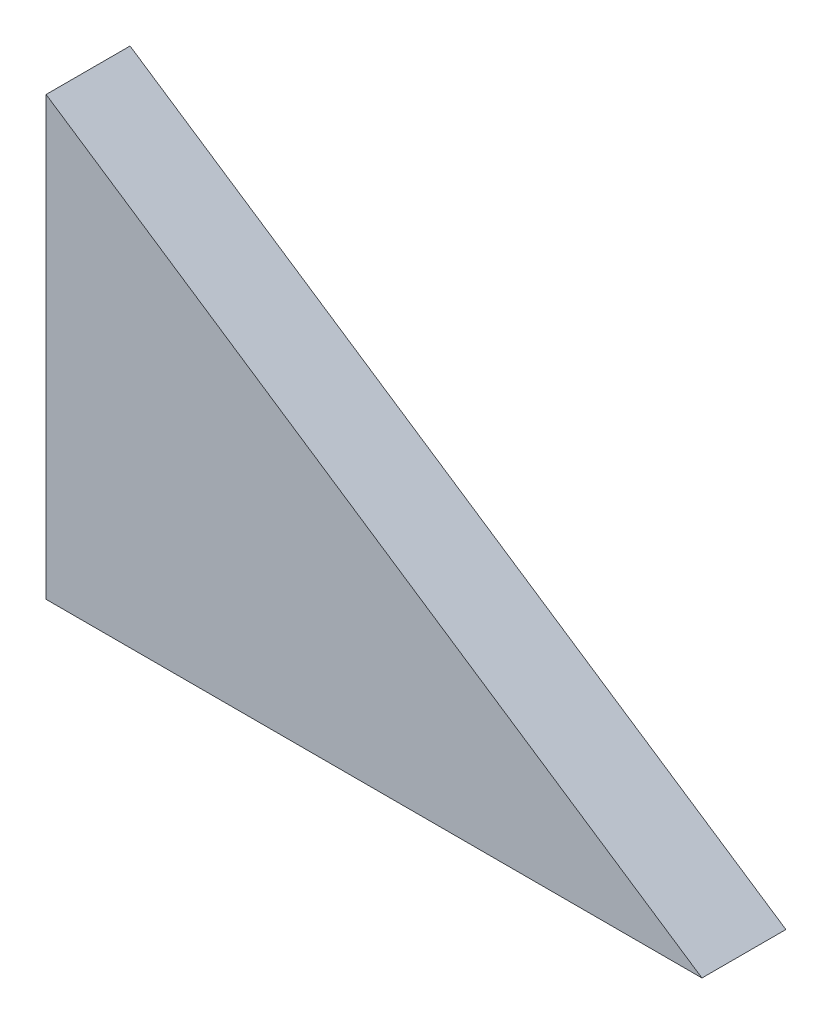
ISO-10303-21;
HEADER;
FILE_DESCRIPTION(('STEP AP214'),'2;1');
FILE_NAME('part.step','',(''),(''),'','','');
FILE_SCHEMA(('AUTOMOTIVE_DESIGN { 1 0 10303 214 1 1 1 1 }'));
ENDSEC;
DATA;
#1=APPLICATION_CONTEXT('core data for automotive mechanical design processes');
#2=APPLICATION_PROTOCOL_DEFINITION('international standard','automotive_design',2000,#1);
#3=PRODUCT_CONTEXT('',#1,'mechanical');
#4=PRODUCT('Part','Part','',(#3));
#5=PRODUCT_RELATED_PRODUCT_CATEGORY('part','',(#4));
#6=PRODUCT_DEFINITION_FORMATION('','',#4);
#7=PRODUCT_DEFINITION_CONTEXT('part definition',#1,'design');
#8=PRODUCT_DEFINITION('design','',#6,#7);
#9=PRODUCT_DEFINITION_SHAPE('','',#8);
#10=(LENGTH_UNIT() NAMED_UNIT(*) SI_UNIT(.MILLI.,.METRE.));
#11=(NAMED_UNIT(*) PLANE_ANGLE_UNIT() SI_UNIT($,.RADIAN.));
#12=(NAMED_UNIT(*) SI_UNIT($,.STERADIAN.) SOLID_ANGLE_UNIT());
#13=UNCERTAINTY_MEASURE_WITH_UNIT(LENGTH_MEASURE(1.E-05),#10,'distance_accuracy_value','');
#14=(GEOMETRIC_REPRESENTATION_CONTEXT(3) GLOBAL_UNCERTAINTY_ASSIGNED_CONTEXT((#13)) GLOBAL_UNIT_ASSIGNED_CONTEXT((#10,
#11,#12)) REPRESENTATION_CONTEXT('',''));
#15=CARTESIAN_POINT('',(0.,0.,0.));
#16=DIRECTION('',(0.,0.,1.));
#17=DIRECTION('',(1.,0.,0.));
#18=AXIS2_PLACEMENT_3D('',#15,#16,#17);
#19=CARTESIAN_POINT('',(9.525,0.,-1.2192));
#20=DIRECTION('',(0.,-1.,0.));
#21=DIRECTION('',(1.,0.,0.));
#22=AXIS2_PLACEMENT_3D('',#19,#20,#21);
#23=PLANE('',#22);
#24=DIRECTION('',(1.,0.,0.));
#25=VECTOR('',#24,1.);
#26=CARTESIAN_POINT('',(9.525,0.,0.));
#27=LINE('',#26,#25);
#28=CARTESIAN_POINT('',(0.,0.,0.));
#29=VERTEX_POINT('',#28);
#30=CARTESIAN_POINT('',(9.525,0.,0.));
#31=VERTEX_POINT('',#30);
#32=EDGE_CURVE('E92',#29,#31,#27,.T.);
#33=ORIENTED_EDGE('',*,*,#32,.F.);
#34=DIRECTION('',(0.,0.,1.));
#35=VECTOR('',#34,1.);
#36=CARTESIAN_POINT('',(0.,0.,-1.2192));
#37=LINE('',#36,#35);
#38=CARTESIAN_POINT('',(0.,0.,-1.2192));
#39=VERTEX_POINT('',#38);
#40=EDGE_CURVE('E11',#39,#29,#37,.T.);
#41=ORIENTED_EDGE('',*,*,#40,.F.);
#42=DIRECTION('',(1.,0.,0.));
#43=VECTOR('',#42,1.);
#44=CARTESIAN_POINT('',(9.525,0.,-1.2192));
#45=LINE('',#44,#43);
#46=CARTESIAN_POINT('',(9.525,0.,-1.2192));
#47=VERTEX_POINT('',#46);
#48=EDGE_CURVE('E84',#39,#47,#45,.T.);
#49=ORIENTED_EDGE('',*,*,#48,.T.);
#50=DIRECTION('',(0.,0.,1.));
#51=VECTOR('',#50,1.);
#52=CARTESIAN_POINT('',(9.525,0.,-1.2192));
#53=LINE('',#52,#51);
#54=EDGE_CURVE('E43',#47,#31,#53,.T.);
#55=ORIENTED_EDGE('',*,*,#54,.T.);
#56=EDGE_LOOP('',(#33,#41,#49,#55));
#57=FACE_BOUND('',#56,.T.);
#58=ADVANCED_FACE('F40',(#57),#23,.T.);
#59=CARTESIAN_POINT('',(0.,0.,-1.2192));
#60=DIRECTION('',(-1.,0.,0.));
#61=DIRECTION('',(0.,0.,1.));
#62=AXIS2_PLACEMENT_3D('',#59,#60,#61);
#63=PLANE('',#62);
#64=DIRECTION('',(0.,-1.,0.));
#65=VECTOR('',#64,1.);
#66=CARTESIAN_POINT('',(0.,0.,0.));
#67=LINE('',#66,#65);
#68=CARTESIAN_POINT('',(0.,6.35,0.));
#69=VERTEX_POINT('',#68);
#70=EDGE_CURVE('E86',#69,#29,#67,.T.);
#71=ORIENTED_EDGE('',*,*,#70,.F.);
#72=DIRECTION('',(0.,0.,1.));
#73=VECTOR('',#72,1.);
#74=CARTESIAN_POINT('',(0.,6.35,-1.2192));
#75=LINE('',#74,#73);
#76=CARTESIAN_POINT('',(0.,6.35,-1.2192));
#77=VERTEX_POINT('',#76);
#78=EDGE_CURVE('E49',#77,#69,#75,.T.);
#79=ORIENTED_EDGE('',*,*,#78,.F.);
#80=DIRECTION('',(0.,-1.,0.));
#81=VECTOR('',#80,1.);
#82=CARTESIAN_POINT('',(0.,0.,-1.2192));
#83=LINE('',#82,#81);
#84=EDGE_CURVE('E81',#77,#39,#83,.T.);
#85=ORIENTED_EDGE('',*,*,#84,.T.);
#86=ORIENTED_EDGE('',*,*,#40,.T.);
#87=EDGE_LOOP('',(#71,#79,#85,#86));
#88=FACE_BOUND('',#87,.T.);
#89=ADVANCED_FACE('F96',(#88),#63,.T.);
#90=CARTESIAN_POINT('',(0.,6.35,-1.2192));
#91=DIRECTION('',(0.554700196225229,0.832050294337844,0.));
#92=DIRECTION('',(-0.832050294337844,0.554700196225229,0.));
#93=AXIS2_PLACEMENT_3D('',#90,#91,#92);
#94=PLANE('',#93);
#95=DIRECTION('',(-0.832050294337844,0.554700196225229,0.));
#96=VECTOR('',#95,1.);
#97=CARTESIAN_POINT('',(0.,6.35,0.));
#98=LINE('',#97,#96);
#99=EDGE_CURVE('E79',#31,#69,#98,.T.);
#100=ORIENTED_EDGE('',*,*,#99,.F.);
#101=ORIENTED_EDGE('',*,*,#54,.F.);
#102=DIRECTION('',(-0.832050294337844,0.554700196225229,0.));
#103=VECTOR('',#102,1.);
#104=CARTESIAN_POINT('',(0.,6.35,-1.2192));
#105=LINE('',#104,#103);
#106=EDGE_CURVE('E77',#47,#77,#105,.T.);
#107=ORIENTED_EDGE('',*,*,#106,.T.);
#108=ORIENTED_EDGE('',*,*,#78,.T.);
#109=EDGE_LOOP('',(#100,#101,#107,#108));
#110=FACE_BOUND('',#109,.T.);
#111=ADVANCED_FACE('F76',(#110),#94,.T.);
#112=CARTESIAN_POINT('',(0.,0.,-1.2192));
#113=DIRECTION('',(0.,0.,-1.));
#114=DIRECTION('',(-1.,0.,0.));
#115=AXIS2_PLACEMENT_3D('',#112,#113,#114);
#116=PLANE('',#115);
#117=ORIENTED_EDGE('',*,*,#48,.F.);
#118=ORIENTED_EDGE('',*,*,#84,.F.);
#119=ORIENTED_EDGE('',*,*,#106,.F.);
#120=EDGE_LOOP('',(#117,#118,#119));
#121=FACE_BOUND('',#120,.T.);
#122=ADVANCED_FACE('F83',(#121),#116,.T.);
#123=CARTESIAN_POINT('',(0.,0.,0.));
#124=DIRECTION('',(0.,0.,-1.));
#125=DIRECTION('',(-1.,0.,0.));
#126=AXIS2_PLACEMENT_3D('',#123,#124,#125);
#127=PLANE('',#126);
#128=ORIENTED_EDGE('',*,*,#32,.T.);
#129=ORIENTED_EDGE('',*,*,#99,.T.);
#130=ORIENTED_EDGE('',*,*,#70,.T.);
#131=EDGE_LOOP('',(#128,#129,#130));
#132=FACE_BOUND('',#131,.T.);
#133=ADVANCED_FACE('F95',(#132),#127,.F.);
#134=CLOSED_SHELL('',(#58,#89,#111,#122,#133));
#135=MANIFOLD_SOLID_BREP('B2',#134);
#136=ADVANCED_BREP_SHAPE_REPRESENTATION('',(#18,#135),#14);
#137=SHAPE_DEFINITION_REPRESENTATION(#9,#136);
ENDSEC;
END-ISO-10303-21;
